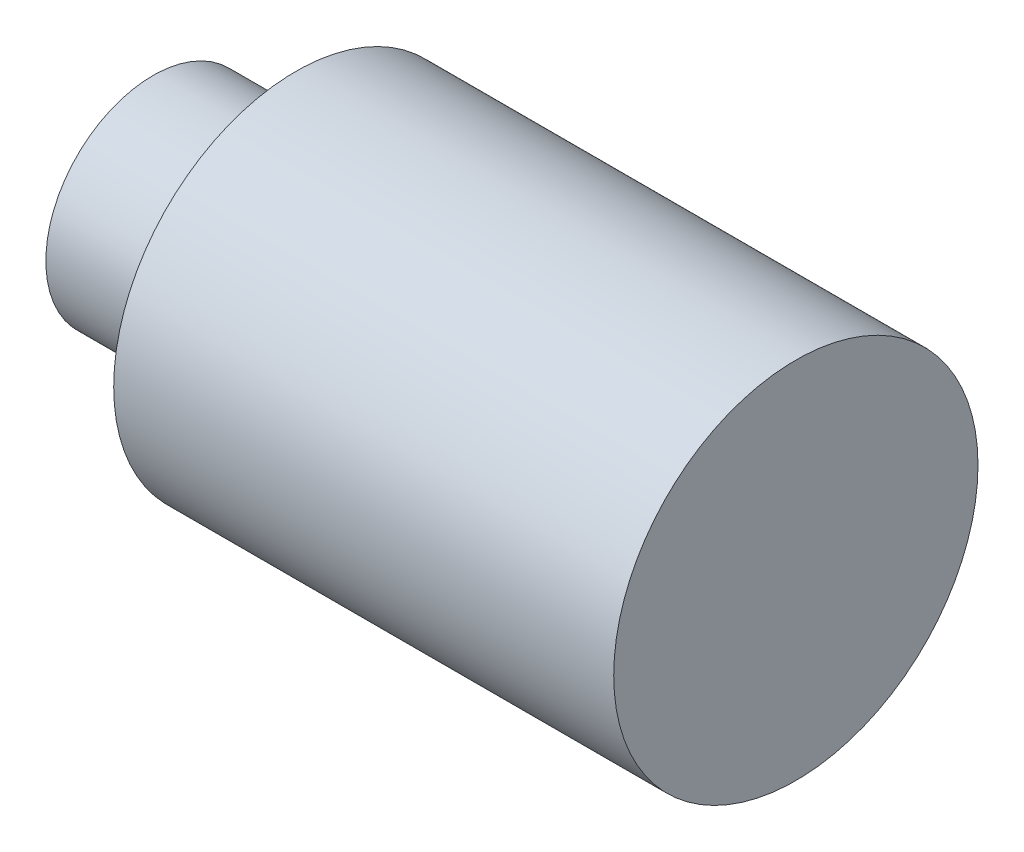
from build123d import *

# Parameters (mm, degrees)
SKETCH_1_R      = 1.5
EXTRUDE_1_DEPTH = 2
SKETCH_2_R      = 2.55
EXTRUDE_2_DEPTH = 7


with BuildPart() as part:
    # Sketch 1 → Extrude 1 (new body)
    with BuildSketch(Plane(origin=(0, 0, 0), x_dir=(0, 0, -1), z_dir=(1, 0, 0))):
        Circle(SKETCH_1_R)
    extrude(amount=EXTRUDE_1_DEPTH)

    # Sketch 2 → Extrude 2 (add)
    with BuildSketch(Plane(origin=(2, 0, 0), x_dir=(0, 0, -1), z_dir=(1, 0, 0))):
        Circle(SKETCH_2_R)
    extrude(amount=EXTRUDE_2_DEPTH)


solid = part.part
